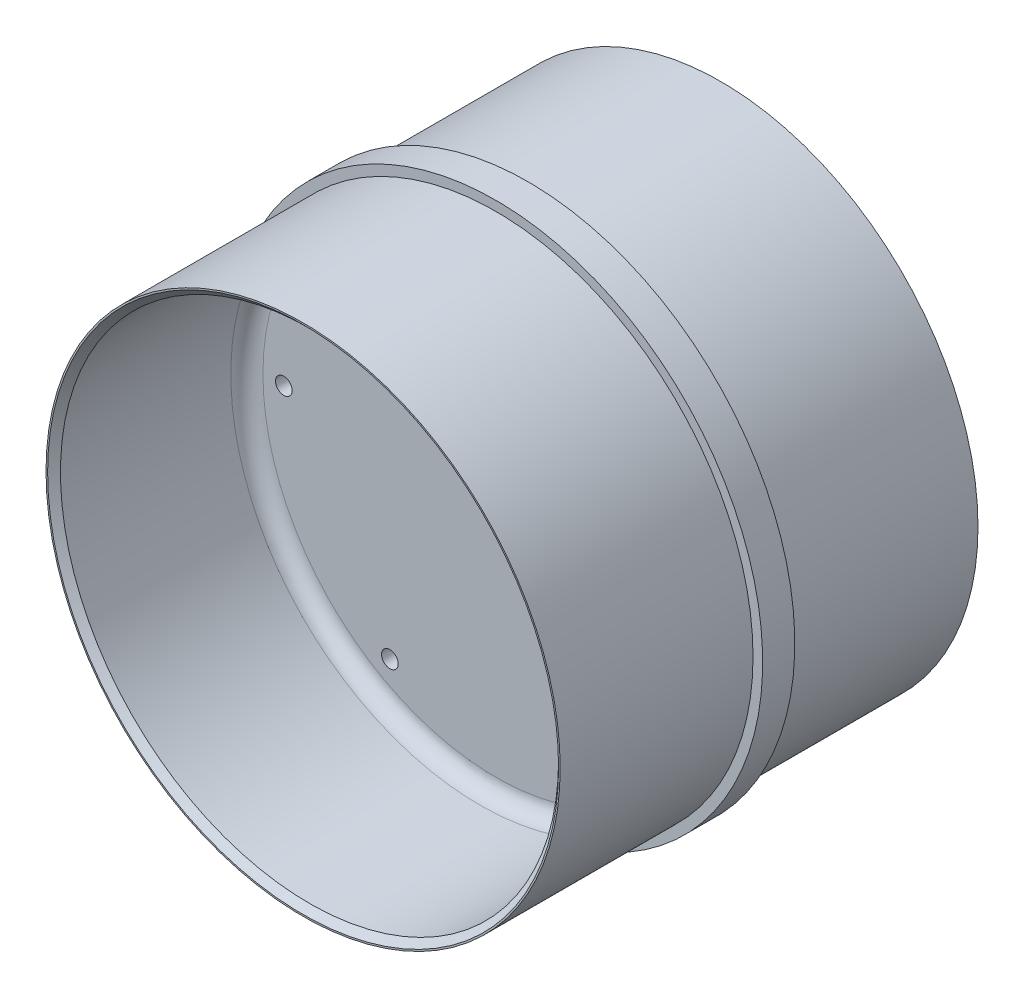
ISO-10303-21;
HEADER;
FILE_DESCRIPTION(('STEP AP214'),'2;1');
FILE_NAME('part.step','',(''),(''),'','','');
FILE_SCHEMA(('AUTOMOTIVE_DESIGN { 1 0 10303 214 1 1 1 1 }'));
ENDSEC;
DATA;
#1=APPLICATION_CONTEXT('core data for automotive mechanical design processes');
#2=APPLICATION_PROTOCOL_DEFINITION('international standard','automotive_design',2000,#1);
#3=PRODUCT_CONTEXT('',#1,'mechanical');
#4=PRODUCT('Part','Part','',(#3));
#5=PRODUCT_RELATED_PRODUCT_CATEGORY('part','',(#4));
#6=PRODUCT_DEFINITION_FORMATION('','',#4);
#7=PRODUCT_DEFINITION_CONTEXT('part definition',#1,'design');
#8=PRODUCT_DEFINITION('design','',#6,#7);
#9=PRODUCT_DEFINITION_SHAPE('','',#8);
#10=(LENGTH_UNIT() NAMED_UNIT(*) SI_UNIT(.MILLI.,.METRE.));
#11=(NAMED_UNIT(*) PLANE_ANGLE_UNIT() SI_UNIT($,.RADIAN.));
#12=(NAMED_UNIT(*) SI_UNIT($,.STERADIAN.) SOLID_ANGLE_UNIT());
#13=UNCERTAINTY_MEASURE_WITH_UNIT(LENGTH_MEASURE(1.E-05),#10,'distance_accuracy_value','');
#14=(GEOMETRIC_REPRESENTATION_CONTEXT(3) GLOBAL_UNCERTAINTY_ASSIGNED_CONTEXT((#13)) GLOBAL_UNIT_ASSIGNED_CONTEXT((#10,
#11,#12)) REPRESENTATION_CONTEXT('',''));
#15=CARTESIAN_POINT('',(0.,0.,0.));
#16=DIRECTION('',(0.,0.,1.));
#17=DIRECTION('',(1.,0.,0.));
#18=AXIS2_PLACEMENT_3D('',#15,#16,#17);
#19=CARTESIAN_POINT('',(0.,0.,-5.));
#20=DIRECTION('',(0.,0.,-1.));
#21=DIRECTION('',(-1.,0.,0.));
#22=AXIS2_PLACEMENT_3D('',#19,#20,#21);
#23=PLANE('',#22);
#24=CARTESIAN_POINT('',(0.,0.,-5.));
#25=DIRECTION('',(0.,0.,-1.));
#26=DIRECTION('',(-1.,0.,0.));
#27=AXIS2_PLACEMENT_3D('',#24,#25,#26);
#28=CIRCLE('',#27,72.5);
#29=CARTESIAN_POINT('',(-72.5,0.,-5.));
#30=VERTEX_POINT('',#29);
#31=EDGE_CURVE('E48',#30,#30,#28,.T.);
#32=ORIENTED_EDGE('',*,*,#31,.T.);
#33=EDGE_LOOP('',(#32));
#34=FACE_BOUND('',#33,.T.);
#35=CARTESIAN_POINT('',(32.9999999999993,57.1576766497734,-5.));
#36=DIRECTION('',(0.,0.,-1.));
#37=DIRECTION('',(-1.,0.,0.));
#38=AXIS2_PLACEMENT_3D('',#35,#36,#37);
#39=CIRCLE('',#38,2.5908);
#40=CARTESIAN_POINT('',(30.4091999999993,57.1576766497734,-5.));
#41=VERTEX_POINT('',#40);
#42=EDGE_CURVE('E113',#41,#41,#39,.F.);
#43=ORIENTED_EDGE('',*,*,#42,.T.);
#44=EDGE_LOOP('',(#43));
#45=FACE_BOUND('',#44,.T.);
#46=CARTESIAN_POINT('',(66.,7.04297731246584E-13,-5.));
#47=DIRECTION('',(0.,0.,-1.));
#48=DIRECTION('',(-1.,0.,0.));
#49=AXIS2_PLACEMENT_3D('',#46,#47,#48);
#50=CIRCLE('',#49,2.5908);
#51=CARTESIAN_POINT('',(63.4092,7.04297731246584E-13,-5.));
#52=VERTEX_POINT('',#51);
#53=EDGE_CURVE('E107',#52,#52,#50,.F.);
#54=ORIENTED_EDGE('',*,*,#53,.T.);
#55=EDGE_LOOP('',(#54));
#56=FACE_BOUND('',#55,.T.);
#57=CARTESIAN_POINT('',(33.0000000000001,-57.1576766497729,-5.));
#58=DIRECTION('',(0.,0.,-1.));
#59=DIRECTION('',(-1.,0.,0.));
#60=AXIS2_PLACEMENT_3D('',#57,#58,#59);
#61=CIRCLE('',#60,2.5908);
#62=CARTESIAN_POINT('',(30.4092000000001,-57.1576766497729,-5.));
#63=VERTEX_POINT('',#62);
#64=EDGE_CURVE('E101',#63,#63,#61,.F.);
#65=ORIENTED_EDGE('',*,*,#64,.T.);
#66=EDGE_LOOP('',(#65));
#67=FACE_BOUND('',#66,.T.);
#68=CARTESIAN_POINT('',(-32.9999999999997,-57.1576766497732,-5.));
#69=DIRECTION('',(0.,0.,-1.));
#70=DIRECTION('',(-1.,0.,0.));
#71=AXIS2_PLACEMENT_3D('',#68,#69,#70);
#72=CIRCLE('',#71,2.5908);
#73=CARTESIAN_POINT('',(-35.5907999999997,-57.1576766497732,-5.));
#74=VERTEX_POINT('',#73);
#75=EDGE_CURVE('E95',#74,#74,#72,.F.);
#76=ORIENTED_EDGE('',*,*,#75,.T.);
#77=EDGE_LOOP('',(#76));
#78=FACE_BOUND('',#77,.T.);
#79=CARTESIAN_POINT('',(-33.0000000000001,57.1576766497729,-5.));
#80=DIRECTION('',(0.,0.,-1.));
#81=DIRECTION('',(-1.,0.,0.));
#82=AXIS2_PLACEMENT_3D('',#79,#80,#81);
#83=CIRCLE('',#82,2.5908);
#84=CARTESIAN_POINT('',(-35.5908000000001,57.1576766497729,-5.));
#85=VERTEX_POINT('',#84);
#86=EDGE_CURVE('E83',#85,#85,#83,.F.);
#87=ORIENTED_EDGE('',*,*,#86,.T.);
#88=EDGE_LOOP('',(#87));
#89=FACE_BOUND('',#88,.T.);
#90=CARTESIAN_POINT('',(-66.,-2.46330733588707E-13,-5.));
#91=DIRECTION('',(0.,0.,-1.));
#92=DIRECTION('',(-1.,0.,0.));
#93=AXIS2_PLACEMENT_3D('',#90,#91,#92);
#94=CIRCLE('',#93,2.5908);
#95=CARTESIAN_POINT('',(-68.5908,-2.46330733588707E-13,-5.));
#96=VERTEX_POINT('',#95);
#97=EDGE_CURVE('E89',#96,#96,#94,.F.);
#98=ORIENTED_EDGE('',*,*,#97,.T.);
#99=EDGE_LOOP('',(#98));
#100=FACE_BOUND('',#99,.T.);
#101=ADVANCED_FACE('F33',(#34,#45,#56,#67,#78,#89,#100),#23,.T.);
#102=CARTESIAN_POINT('',(0.,0.,-77.));
#103=DIRECTION('',(0.,0.,-1.));
#104=DIRECTION('',(-1.,0.,0.));
#105=AXIS2_PLACEMENT_3D('',#102,#103,#104);
#106=CYLINDRICAL_SURFACE('',#105,77.5);
#107=CARTESIAN_POINT('',(0.,0.,-9.99999999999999));
#108=DIRECTION('',(0.,0.,-1.));
#109=DIRECTION('',(-1.,0.,0.));
#110=AXIS2_PLACEMENT_3D('',#107,#108,#109);
#111=CIRCLE('',#110,77.5);
#112=CARTESIAN_POINT('',(-77.5,0.,-9.99999999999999));
#113=VERTEX_POINT('',#112);
#114=EDGE_CURVE('E44',#113,#113,#111,.F.);
#115=ORIENTED_EDGE('',*,*,#114,.T.);
#116=EDGE_LOOP('',(#115));
#117=FACE_BOUND('',#116,.T.);
#118=CARTESIAN_POINT('',(0.,0.,-63.));
#119=DIRECTION('',(0.,0.,-1.));
#120=DIRECTION('',(-1.,0.,0.));
#121=AXIS2_PLACEMENT_3D('',#118,#119,#120);
#122=CIRCLE('',#121,77.5);
#123=CARTESIAN_POINT('',(-77.5,0.,-63.));
#124=VERTEX_POINT('',#123);
#125=EDGE_CURVE('E62',#124,#124,#122,.T.);
#126=ORIENTED_EDGE('',*,*,#125,.T.);
#127=EDGE_LOOP('',(#126));
#128=FACE_BOUND('',#127,.T.);
#129=ADVANCED_FACE('F155',(#117,#128),#106,.F.);
#130=CARTESIAN_POINT('',(0.,77.5,-65.));
#131=DIRECTION('',(0.,0.,-1.));
#132=DIRECTION('',(-1.,0.,0.));
#133=AXIS2_PLACEMENT_3D('',#130,#131,#132);
#134=PLANE('',#133);
#135=CARTESIAN_POINT('',(0.,0.,-65.));
#136=DIRECTION('',(0.,0.,-1.));
#137=DIRECTION('',(-1.,0.,0.));
#138=AXIS2_PLACEMENT_3D('',#135,#136,#137);
#139=CIRCLE('',#138,79.5000000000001);
#140=CARTESIAN_POINT('',(-79.5000000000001,0.,-65.));
#141=VERTEX_POINT('',#140);
#142=EDGE_CURVE('E59',#141,#141,#139,.F.);
#143=ORIENTED_EDGE('',*,*,#142,.T.);
#144=EDGE_LOOP('',(#143));
#145=FACE_BOUND('',#144,.T.);
#146=CARTESIAN_POINT('',(0.,0.,-65.));
#147=DIRECTION('',(0.,0.,-1.));
#148=DIRECTION('',(-1.,0.,0.));
#149=AXIS2_PLACEMENT_3D('',#146,#147,#148);
#150=CIRCLE('',#149,80.);
#151=CARTESIAN_POINT('',(-80.,0.,-65.));
#152=VERTEX_POINT('',#151);
#153=EDGE_CURVE('E65',#152,#152,#150,.T.);
#154=ORIENTED_EDGE('',*,*,#153,.T.);
#155=EDGE_LOOP('',(#154));
#156=FACE_BOUND('',#155,.T.);
#157=ADVANCED_FACE('F161',(#145,#156),#134,.T.);
#158=CARTESIAN_POINT('',(0.,0.,-77.));
#159=DIRECTION('',(0.,0.,-1.));
#160=DIRECTION('',(-1.,0.,0.));
#161=AXIS2_PLACEMENT_3D('',#158,#159,#160);
#162=CYLINDRICAL_SURFACE('',#161,80.);
#163=CARTESIAN_POINT('',(0.,0.,-4.99999999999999));
#164=DIRECTION('',(0.,0.,-1.));
#165=DIRECTION('',(-1.,0.,0.));
#166=AXIS2_PLACEMENT_3D('',#163,#164,#165);
#167=CIRCLE('',#166,80.);
#168=CARTESIAN_POINT('',(-80.,0.,-4.99999999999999));
#169=VERTEX_POINT('',#168);
#170=EDGE_CURVE('E68',#169,#169,#167,.T.);
#171=ORIENTED_EDGE('',*,*,#170,.T.);
#172=EDGE_LOOP('',(#171));
#173=FACE_BOUND('',#172,.T.);
#174=ORIENTED_EDGE('',*,*,#153,.F.);
#175=EDGE_LOOP('',(#174));
#176=FACE_BOUND('',#175,.T.);
#177=ADVANCED_FACE('F324',(#173,#176),#162,.T.);
#178=CARTESIAN_POINT('',(0.,80.,-5.));
#179=DIRECTION('',(0.,0.,-1.));
#180=DIRECTION('',(-1.,0.,0.));
#181=AXIS2_PLACEMENT_3D('',#178,#179,#180);
#182=PLANE('',#181);
#183=CARTESIAN_POINT('',(0.,0.,-4.99999999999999));
#184=DIRECTION('',(0.,0.,-1.));
#185=DIRECTION('',(-1.,0.,0.));
#186=AXIS2_PLACEMENT_3D('',#183,#184,#185);
#187=CIRCLE('',#186,83.);
#188=CARTESIAN_POINT('',(-83.,0.,-4.99999999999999));
#189=VERTEX_POINT('',#188);
#190=EDGE_CURVE('E71',#189,#189,#187,.T.);
#191=ORIENTED_EDGE('',*,*,#190,.T.);
#192=EDGE_LOOP('',(#191));
#193=FACE_BOUND('',#192,.T.);
#194=ORIENTED_EDGE('',*,*,#170,.F.);
#195=EDGE_LOOP('',(#194));
#196=FACE_BOUND('',#195,.T.);
#197=ADVANCED_FACE('F316',(#193,#196),#182,.T.);
#198=CARTESIAN_POINT('',(0.,0.,-77.));
#199=DIRECTION('',(0.,0.,-1.));
#200=DIRECTION('',(-1.,0.,0.));
#201=AXIS2_PLACEMENT_3D('',#198,#199,#200);
#202=CYLINDRICAL_SURFACE('',#201,83.);
#203=CARTESIAN_POINT('',(0.,0.,5.));
#204=DIRECTION('',(0.,0.,-1.));
#205=DIRECTION('',(-1.,0.,0.));
#206=AXIS2_PLACEMENT_3D('',#203,#204,#205);
#207=CIRCLE('',#206,83.);
#208=CARTESIAN_POINT('',(-83.,0.,5.));
#209=VERTEX_POINT('',#208);
#210=EDGE_CURVE('E74',#209,#209,#207,.T.);
#211=ORIENTED_EDGE('',*,*,#210,.T.);
#212=EDGE_LOOP('',(#211));
#213=FACE_BOUND('',#212,.T.);
#214=ORIENTED_EDGE('',*,*,#190,.F.);
#215=EDGE_LOOP('',(#214));
#216=FACE_BOUND('',#215,.T.);
#217=ADVANCED_FACE('F308',(#213,#216),#202,.T.);
#218=CARTESIAN_POINT('',(0.,80.,5.));
#219=DIRECTION('',(0.,0.,1.));
#220=DIRECTION('',(1.,0.,0.));
#221=AXIS2_PLACEMENT_3D('',#218,#219,#220);
#222=PLANE('',#221);
#223=CARTESIAN_POINT('',(0.,0.,5.));
#224=DIRECTION('',(0.,0.,-1.));
#225=DIRECTION('',(-1.,0.,0.));
#226=AXIS2_PLACEMENT_3D('',#223,#224,#225);
#227=CIRCLE('',#226,80.);
#228=CARTESIAN_POINT('',(-80.,0.,5.));
#229=VERTEX_POINT('',#228);
#230=EDGE_CURVE('E77',#229,#229,#227,.T.);
#231=ORIENTED_EDGE('',*,*,#230,.T.);
#232=EDGE_LOOP('',(#231));
#233=FACE_BOUND('',#232,.T.);
#234=ORIENTED_EDGE('',*,*,#210,.F.);
#235=EDGE_LOOP('',(#234));
#236=FACE_BOUND('',#235,.T.);
#237=ADVANCED_FACE('F301',(#233,#236),#222,.T.);
#238=CARTESIAN_POINT('',(0.,0.,-77.));
#239=DIRECTION('',(0.,0.,-1.));
#240=DIRECTION('',(-1.,0.,0.));
#241=AXIS2_PLACEMENT_3D('',#238,#239,#240);
#242=CYLINDRICAL_SURFACE('',#241,80.);
#243=CARTESIAN_POINT('',(0.,0.,65.));
#244=DIRECTION('',(0.,0.,-1.));
#245=DIRECTION('',(-1.,0.,0.));
#246=AXIS2_PLACEMENT_3D('',#243,#244,#245);
#247=CIRCLE('',#246,80.);
#248=CARTESIAN_POINT('',(-80.,0.,65.));
#249=VERTEX_POINT('',#248);
#250=EDGE_CURVE('E80',#249,#249,#247,.T.);
#251=ORIENTED_EDGE('',*,*,#250,.T.);
#252=EDGE_LOOP('',(#251));
#253=FACE_BOUND('',#252,.T.);
#254=ORIENTED_EDGE('',*,*,#230,.F.);
#255=EDGE_LOOP('',(#254));
#256=FACE_BOUND('',#255,.T.);
#257=ADVANCED_FACE('F290',(#253,#256),#242,.T.);
#258=CARTESIAN_POINT('',(0.,77.5,65.));
#259=DIRECTION('',(0.,0.,1.));
#260=DIRECTION('',(1.,0.,0.));
#261=AXIS2_PLACEMENT_3D('',#258,#259,#260);
#262=PLANE('',#261);
#263=CARTESIAN_POINT('',(0.,0.,65.));
#264=DIRECTION('',(0.,0.,1.));
#265=DIRECTION('',(1.,0.,0.));
#266=AXIS2_PLACEMENT_3D('',#263,#264,#265);
#267=CIRCLE('',#266,79.5);
#268=CARTESIAN_POINT('',(79.5,0.,65.));
#269=VERTEX_POINT('',#268);
#270=EDGE_CURVE('E56',#269,#269,#267,.F.);
#271=ORIENTED_EDGE('',*,*,#270,.T.);
#272=EDGE_LOOP('',(#271));
#273=FACE_BOUND('',#272,.T.);
#274=ORIENTED_EDGE('',*,*,#250,.F.);
#275=EDGE_LOOP('',(#274));
#276=FACE_BOUND('',#275,.T.);
#277=ADVANCED_FACE('F250',(#273,#276),#262,.T.);
#278=CARTESIAN_POINT('',(0.,0.,-77.));
#279=DIRECTION('',(0.,0.,-1.));
#280=DIRECTION('',(-1.,0.,0.));
#281=AXIS2_PLACEMENT_3D('',#278,#279,#280);
#282=CYLINDRICAL_SURFACE('',#281,77.5);
#283=CARTESIAN_POINT('',(0.,0.,9.99999999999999));
#284=DIRECTION('',(0.,0.,1.));
#285=DIRECTION('',(1.,0.,0.));
#286=AXIS2_PLACEMENT_3D('',#283,#284,#285);
#287=CIRCLE('',#286,77.5);
#288=CARTESIAN_POINT('',(77.5,0.,9.99999999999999));
#289=VERTEX_POINT('',#288);
#290=EDGE_CURVE('E40',#289,#289,#287,.F.);
#291=ORIENTED_EDGE('',*,*,#290,.T.);
#292=EDGE_LOOP('',(#291));
#293=FACE_BOUND('',#292,.T.);
#294=CARTESIAN_POINT('',(0.,0.,63.));
#295=DIRECTION('',(0.,0.,1.));
#296=DIRECTION('',(1.,0.,0.));
#297=AXIS2_PLACEMENT_3D('',#294,#295,#296);
#298=CIRCLE('',#297,77.5);
#299=CARTESIAN_POINT('',(77.5,0.,63.));
#300=VERTEX_POINT('',#299);
#301=EDGE_CURVE('E53',#300,#300,#298,.T.);
#302=ORIENTED_EDGE('',*,*,#301,.T.);
#303=EDGE_LOOP('',(#302));
#304=FACE_BOUND('',#303,.T.);
#305=ADVANCED_FACE('F126',(#293,#304),#282,.F.);
#306=CARTESIAN_POINT('',(0.,0.,5.));
#307=DIRECTION('',(0.,0.,1.));
#308=DIRECTION('',(1.,0.,0.));
#309=AXIS2_PLACEMENT_3D('',#306,#307,#308);
#310=PLANE('',#309);
#311=CARTESIAN_POINT('',(0.,0.,5.));
#312=DIRECTION('',(0.,0.,1.));
#313=DIRECTION('',(1.,0.,0.));
#314=AXIS2_PLACEMENT_3D('',#311,#312,#313);
#315=CIRCLE('',#314,72.5);
#316=CARTESIAN_POINT('',(72.5,0.,5.));
#317=VERTEX_POINT('',#316);
#318=EDGE_CURVE('E10',#317,#317,#315,.T.);
#319=ORIENTED_EDGE('',*,*,#318,.T.);
#320=EDGE_LOOP('',(#319));
#321=FACE_BOUND('',#320,.T.);
#322=CARTESIAN_POINT('',(32.9999999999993,57.1576766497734,5.));
#323=DIRECTION('',(0.,0.,1.));
#324=DIRECTION('',(1.,0.,0.));
#325=AXIS2_PLACEMENT_3D('',#322,#323,#324);
#326=CIRCLE('',#325,2.5908);
#327=CARTESIAN_POINT('',(35.5907999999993,57.1576766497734,5.));
#328=VERTEX_POINT('',#327);
#329=EDGE_CURVE('E116',#328,#328,#326,.T.);
#330=ORIENTED_EDGE('',*,*,#329,.F.);
#331=EDGE_LOOP('',(#330));
#332=FACE_BOUND('',#331,.T.);
#333=CARTESIAN_POINT('',(66.,7.04297731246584E-13,5.));
#334=DIRECTION('',(0.,0.,1.));
#335=DIRECTION('',(1.,0.,0.));
#336=AXIS2_PLACEMENT_3D('',#333,#334,#335);
#337=CIRCLE('',#336,2.5908);
#338=CARTESIAN_POINT('',(68.5908,7.04297731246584E-13,5.));
#339=VERTEX_POINT('',#338);
#340=EDGE_CURVE('E110',#339,#339,#337,.T.);
#341=ORIENTED_EDGE('',*,*,#340,.F.);
#342=EDGE_LOOP('',(#341));
#343=FACE_BOUND('',#342,.T.);
#344=CARTESIAN_POINT('',(33.0000000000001,-57.1576766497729,5.));
#345=DIRECTION('',(0.,0.,1.));
#346=DIRECTION('',(1.,0.,0.));
#347=AXIS2_PLACEMENT_3D('',#344,#345,#346);
#348=CIRCLE('',#347,2.5908);
#349=CARTESIAN_POINT('',(35.5908000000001,-57.1576766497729,5.));
#350=VERTEX_POINT('',#349);
#351=EDGE_CURVE('E104',#350,#350,#348,.T.);
#352=ORIENTED_EDGE('',*,*,#351,.F.);
#353=EDGE_LOOP('',(#352));
#354=FACE_BOUND('',#353,.T.);
#355=CARTESIAN_POINT('',(-32.9999999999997,-57.1576766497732,5.));
#356=DIRECTION('',(0.,0.,1.));
#357=DIRECTION('',(1.,0.,0.));
#358=AXIS2_PLACEMENT_3D('',#355,#356,#357);
#359=CIRCLE('',#358,2.5908);
#360=CARTESIAN_POINT('',(-30.4091999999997,-57.1576766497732,5.));
#361=VERTEX_POINT('',#360);
#362=EDGE_CURVE('E98',#361,#361,#359,.T.);
#363=ORIENTED_EDGE('',*,*,#362,.F.);
#364=EDGE_LOOP('',(#363));
#365=FACE_BOUND('',#364,.T.);
#366=CARTESIAN_POINT('',(-66.,-2.46330733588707E-13,5.));
#367=DIRECTION('',(0.,0.,1.));
#368=DIRECTION('',(1.,0.,0.));
#369=AXIS2_PLACEMENT_3D('',#366,#367,#368);
#370=CIRCLE('',#369,2.5908);
#371=CARTESIAN_POINT('',(-63.4092,-2.46330733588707E-13,5.));
#372=VERTEX_POINT('',#371);
#373=EDGE_CURVE('E92',#372,#372,#370,.T.);
#374=ORIENTED_EDGE('',*,*,#373,.F.);
#375=EDGE_LOOP('',(#374));
#376=FACE_BOUND('',#375,.T.);
#377=CARTESIAN_POINT('',(-33.0000000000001,57.1576766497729,5.));
#378=DIRECTION('',(0.,0.,1.));
#379=DIRECTION('',(1.,0.,0.));
#380=AXIS2_PLACEMENT_3D('',#377,#378,#379);
#381=CIRCLE('',#380,2.5908);
#382=CARTESIAN_POINT('',(-30.4092000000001,57.1576766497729,5.));
#383=VERTEX_POINT('',#382);
#384=EDGE_CURVE('E86',#383,#383,#381,.T.);
#385=ORIENTED_EDGE('',*,*,#384,.F.);
#386=EDGE_LOOP('',(#385));
#387=FACE_BOUND('',#386,.T.);
#388=ADVANCED_FACE('F122',(#321,#332,#343,#354,#365,#376,#387),#310,.T.);
#389=CARTESIAN_POINT('',(0.,0.,-63.));
#390=DIRECTION('',(0.,0.,-1.));
#391=DIRECTION('',(-1.,0.,0.));
#392=AXIS2_PLACEMENT_3D('',#389,#390,#391);
#393=CONICAL_SURFACE('',#392,77.5,0.785398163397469);
#394=ORIENTED_EDGE('',*,*,#142,.F.);
#395=EDGE_LOOP('',(#394));
#396=FACE_BOUND('',#395,.T.);
#397=ORIENTED_EDGE('',*,*,#125,.F.);
#398=EDGE_LOOP('',(#397));
#399=FACE_BOUND('',#398,.T.);
#400=ADVANCED_FACE('F125',(#396,#399),#393,.F.);
#401=CARTESIAN_POINT('',(0.,0.,65.));
#402=DIRECTION('',(0.,0.,1.));
#403=DIRECTION('',(1.,0.,0.));
#404=AXIS2_PLACEMENT_3D('',#401,#402,#403);
#405=CONICAL_SURFACE('',#404,79.5,0.785398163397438);
#406=ORIENTED_EDGE('',*,*,#301,.F.);
#407=EDGE_LOOP('',(#406));
#408=FACE_BOUND('',#407,.T.);
#409=ORIENTED_EDGE('',*,*,#270,.F.);
#410=EDGE_LOOP('',(#409));
#411=FACE_BOUND('',#410,.T.);
#412=ADVANCED_FACE('F141',(#408,#411),#405,.F.);
#413=CARTESIAN_POINT('',(-33.0000000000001,57.1576766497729,5.));
#414=DIRECTION('',(0.,0.,1.));
#415=DIRECTION('',(1.,0.,0.));
#416=AXIS2_PLACEMENT_3D('',#413,#414,#415);
#417=CYLINDRICAL_SURFACE('',#416,2.5908);
#418=ORIENTED_EDGE('',*,*,#86,.F.);
#419=EDGE_LOOP('',(#418));
#420=FACE_BOUND('',#419,.T.);
#421=ORIENTED_EDGE('',*,*,#384,.T.);
#422=EDGE_LOOP('',(#421));
#423=FACE_BOUND('',#422,.T.);
#424=ADVANCED_FACE('F138',(#420,#423),#417,.F.);
#425=CARTESIAN_POINT('',(-66.,-2.46330733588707E-13,5.));
#426=DIRECTION('',(0.,0.,1.));
#427=DIRECTION('',(1.,0.,0.));
#428=AXIS2_PLACEMENT_3D('',#425,#426,#427);
#429=CYLINDRICAL_SURFACE('',#428,2.5908);
#430=ORIENTED_EDGE('',*,*,#97,.F.);
#431=EDGE_LOOP('',(#430));
#432=FACE_BOUND('',#431,.T.);
#433=ORIENTED_EDGE('',*,*,#373,.T.);
#434=EDGE_LOOP('',(#433));
#435=FACE_BOUND('',#434,.T.);
#436=ADVANCED_FACE('F140',(#432,#435),#429,.F.);
#437=CARTESIAN_POINT('',(-32.9999999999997,-57.1576766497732,5.));
#438=DIRECTION('',(0.,0.,1.));
#439=DIRECTION('',(1.,0.,0.));
#440=AXIS2_PLACEMENT_3D('',#437,#438,#439);
#441=CYLINDRICAL_SURFACE('',#440,2.5908);
#442=ORIENTED_EDGE('',*,*,#75,.F.);
#443=EDGE_LOOP('',(#442));
#444=FACE_BOUND('',#443,.T.);
#445=ORIENTED_EDGE('',*,*,#362,.T.);
#446=EDGE_LOOP('',(#445));
#447=FACE_BOUND('',#446,.T.);
#448=ADVANCED_FACE('F148',(#444,#447),#441,.F.);
#449=CARTESIAN_POINT('',(33.0000000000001,-57.1576766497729,5.));
#450=DIRECTION('',(0.,0.,1.));
#451=DIRECTION('',(1.,0.,0.));
#452=AXIS2_PLACEMENT_3D('',#449,#450,#451);
#453=CYLINDRICAL_SURFACE('',#452,2.5908);
#454=ORIENTED_EDGE('',*,*,#64,.F.);
#455=EDGE_LOOP('',(#454));
#456=FACE_BOUND('',#455,.T.);
#457=ORIENTED_EDGE('',*,*,#351,.T.);
#458=EDGE_LOOP('',(#457));
#459=FACE_BOUND('',#458,.T.);
#460=ADVANCED_FACE('F189',(#456,#459),#453,.F.);
#461=CARTESIAN_POINT('',(66.,7.04297731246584E-13,5.));
#462=DIRECTION('',(0.,0.,1.));
#463=DIRECTION('',(1.,0.,0.));
#464=AXIS2_PLACEMENT_3D('',#461,#462,#463);
#465=CYLINDRICAL_SURFACE('',#464,2.5908);
#466=ORIENTED_EDGE('',*,*,#53,.F.);
#467=EDGE_LOOP('',(#466));
#468=FACE_BOUND('',#467,.T.);
#469=ORIENTED_EDGE('',*,*,#340,.T.);
#470=EDGE_LOOP('',(#469));
#471=FACE_BOUND('',#470,.T.);
#472=ADVANCED_FACE('F177',(#468,#471),#465,.F.);
#473=CARTESIAN_POINT('',(32.9999999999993,57.1576766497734,5.));
#474=DIRECTION('',(0.,0.,1.));
#475=DIRECTION('',(1.,0.,0.));
#476=AXIS2_PLACEMENT_3D('',#473,#474,#475);
#477=CYLINDRICAL_SURFACE('',#476,2.5908);
#478=ORIENTED_EDGE('',*,*,#42,.F.);
#479=EDGE_LOOP('',(#478));
#480=FACE_BOUND('',#479,.T.);
#481=ORIENTED_EDGE('',*,*,#329,.T.);
#482=EDGE_LOOP('',(#481));
#483=FACE_BOUND('',#482,.T.);
#484=ADVANCED_FACE('F120',(#480,#483),#477,.F.);
#485=CARTESIAN_POINT('',(0.,0.,-9.99999999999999));
#486=DIRECTION('',(0.,0.,-1.));
#487=DIRECTION('',(-1.,0.,0.));
#488=AXIS2_PLACEMENT_3D('',#485,#486,#487);
#489=TOROIDAL_SURFACE('',#488,72.5,5.);
#490=ORIENTED_EDGE('',*,*,#114,.F.);
#491=EDGE_LOOP('',(#490));
#492=FACE_BOUND('',#491,.T.);
#493=ORIENTED_EDGE('',*,*,#31,.F.);
#494=EDGE_LOOP('',(#493));
#495=FACE_BOUND('',#494,.T.);
#496=ADVANCED_FACE('F169',(#492,#495),#489,.F.);
#497=CARTESIAN_POINT('',(0.,0.,9.99999999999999));
#498=DIRECTION('',(0.,0.,1.));
#499=DIRECTION('',(1.,0.,0.));
#500=AXIS2_PLACEMENT_3D('',#497,#498,#499);
#501=TOROIDAL_SURFACE('',#500,72.5,5.);
#502=ORIENTED_EDGE('',*,*,#318,.F.);
#503=EDGE_LOOP('',(#502));
#504=FACE_BOUND('',#503,.T.);
#505=ORIENTED_EDGE('',*,*,#290,.F.);
#506=EDGE_LOOP('',(#505));
#507=FACE_BOUND('',#506,.T.);
#508=ADVANCED_FACE('F35',(#504,#507),#501,.F.);
#509=CLOSED_SHELL('',(#101,#129,#157,#177,#197,#217,#237,#257,#277,#305,#388,#400,#412,#424,
#436,#448,#460,#472,#484,#496,#508));
#510=MANIFOLD_SOLID_BREP('B2',#509);
#511=ADVANCED_BREP_SHAPE_REPRESENTATION('',(#18,#510),#14);
#512=SHAPE_DEFINITION_REPRESENTATION(#9,#511);
ENDSEC;
END-ISO-10303-21;
